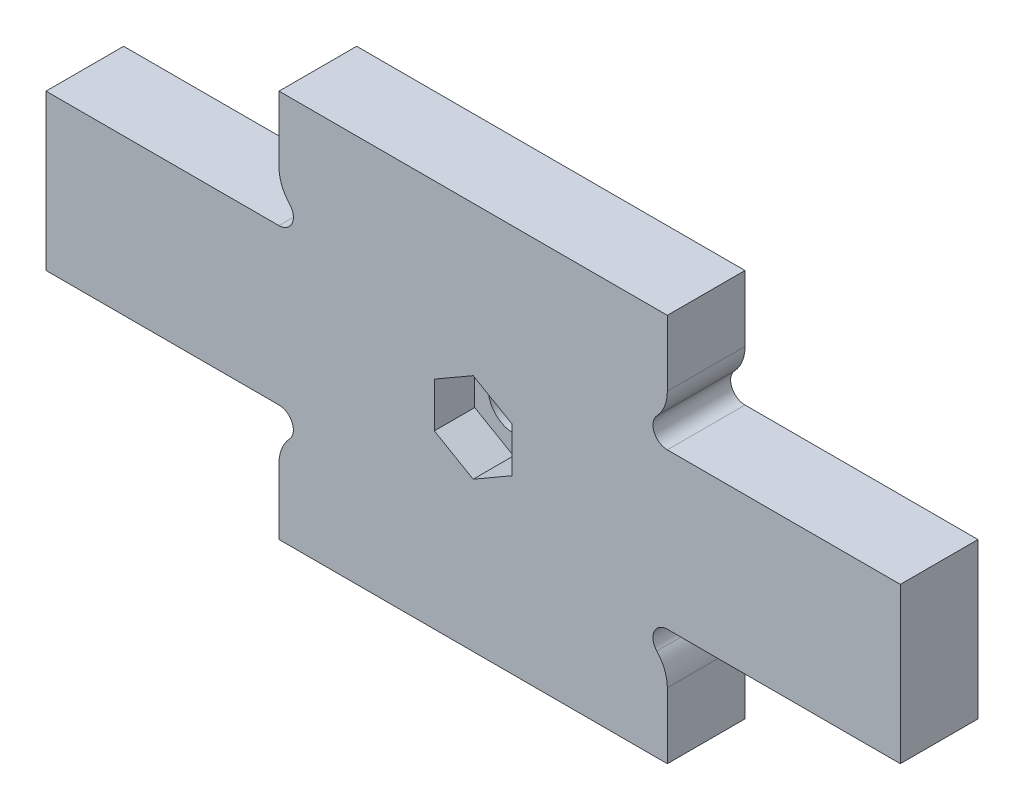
ISO-10303-21;
HEADER;
FILE_DESCRIPTION(('STEP AP214'),'2;1');
FILE_NAME('part.step','',(''),(''),'','','');
FILE_SCHEMA(('AUTOMOTIVE_DESIGN { 1 0 10303 214 1 1 1 1 }'));
ENDSEC;
DATA;
#1=APPLICATION_CONTEXT('core data for automotive mechanical design processes');
#2=APPLICATION_PROTOCOL_DEFINITION('international standard','automotive_design',2000,#1);
#3=PRODUCT_CONTEXT('',#1,'mechanical');
#4=PRODUCT('Part','Part','',(#3));
#5=PRODUCT_RELATED_PRODUCT_CATEGORY('part','',(#4));
#6=PRODUCT_DEFINITION_FORMATION('','',#4);
#7=PRODUCT_DEFINITION_CONTEXT('part definition',#1,'design');
#8=PRODUCT_DEFINITION('design','',#6,#7);
#9=PRODUCT_DEFINITION_SHAPE('','',#8);
#10=(LENGTH_UNIT() NAMED_UNIT(*) SI_UNIT(.MILLI.,.METRE.));
#11=(NAMED_UNIT(*) PLANE_ANGLE_UNIT() SI_UNIT($,.RADIAN.));
#12=(NAMED_UNIT(*) SI_UNIT($,.STERADIAN.) SOLID_ANGLE_UNIT());
#13=UNCERTAINTY_MEASURE_WITH_UNIT(LENGTH_MEASURE(1.E-05),#10,'distance_accuracy_value','');
#14=(GEOMETRIC_REPRESENTATION_CONTEXT(3) GLOBAL_UNCERTAINTY_ASSIGNED_CONTEXT((#13)) GLOBAL_UNIT_ASSIGNED_CONTEXT((#10,
#11,#12)) REPRESENTATION_CONTEXT('',''));
#15=CARTESIAN_POINT('',(0.,0.,0.));
#16=DIRECTION('',(0.,0.,1.));
#17=DIRECTION('',(1.,0.,0.));
#18=AXIS2_PLACEMENT_3D('',#15,#16,#17);
#19=CARTESIAN_POINT('',(0.,0.,0.));
#20=DIRECTION('',(0.,0.,1.));
#21=DIRECTION('',(1.,0.,0.));
#22=AXIS2_PLACEMENT_3D('',#19,#20,#21);
#23=CYLINDRICAL_SURFACE('',#22,3.25);
#24=CARTESIAN_POINT('',(0.,0.,0.));
#25=DIRECTION('',(0.,0.,1.));
#26=DIRECTION('',(1.,0.,0.));
#27=AXIS2_PLACEMENT_3D('',#24,#25,#26);
#28=CIRCLE('',#27,3.25);
#29=CARTESIAN_POINT('',(3.25,0.,0.));
#30=VERTEX_POINT('',#29);
#31=EDGE_CURVE('E227',#30,#30,#28,.T.);
#32=ORIENTED_EDGE('',*,*,#31,.F.);
#33=EDGE_LOOP('',(#32));
#34=FACE_BOUND('',#33,.T.);
#35=CARTESIAN_POINT('',(0.,0.,4.8));
#36=DIRECTION('',(0.,0.,1.));
#37=DIRECTION('',(1.,0.,0.));
#38=AXIS2_PLACEMENT_3D('',#35,#36,#37);
#39=CIRCLE('',#38,3.25);
#40=CARTESIAN_POINT('',(3.25,0.,4.8));
#41=VERTEX_POINT('',#40);
#42=EDGE_CURVE('E45',#41,#41,#39,.F.);
#43=ORIENTED_EDGE('',*,*,#42,.F.);
#44=EDGE_LOOP('',(#43));
#45=FACE_BOUND('',#44,.T.);
#46=ADVANCED_FACE('F41',(#34,#45),#23,.F.);
#47=CARTESIAN_POINT('',(19.9999999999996,-16.5321469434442,10.));
#48=DIRECTION('',(0.,0.,-1.));
#49=DIRECTION('',(-1.,0.,0.));
#50=AXIS2_PLACEMENT_3D('',#47,#48,#49);
#51=CYLINDRICAL_SURFACE('',#50,5.00000000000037);
#52=CARTESIAN_POINT('',(19.9999999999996,-16.5321469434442,0.));
#53=DIRECTION('',(0.,0.,1.));
#54=DIRECTION('',(1.,0.,0.));
#55=AXIS2_PLACEMENT_3D('',#52,#53,#54);
#56=CIRCLE('',#55,5.00000000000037);
#57=CARTESIAN_POINT('',(25.,-16.5321469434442,0.));
#58=VERTEX_POINT('',#57);
#59=CARTESIAN_POINT('',(23.6496350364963,-13.1145214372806,0.));
#60=VERTEX_POINT('',#59);
#61=EDGE_CURVE('E223',#58,#60,#56,.T.);
#62=ORIENTED_EDGE('',*,*,#61,.T.);
#63=DIRECTION('',(0.,0.,-1.));
#64=VECTOR('',#63,1.);
#65=CARTESIAN_POINT('',(23.6496350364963,-13.1145214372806,10.));
#66=LINE('',#65,#64);
#67=CARTESIAN_POINT('',(23.6496350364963,-13.1145214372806,10.));
#68=VERTEX_POINT('',#67);
#69=EDGE_CURVE('E11',#68,#60,#66,.T.);
#70=ORIENTED_EDGE('',*,*,#69,.F.);
#71=CARTESIAN_POINT('',(19.9999999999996,-16.5321469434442,10.));
#72=DIRECTION('',(0.,0.,1.));
#73=DIRECTION('',(1.,0.,0.));
#74=AXIS2_PLACEMENT_3D('',#71,#72,#73);
#75=CIRCLE('',#74,5.00000000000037);
#76=CARTESIAN_POINT('',(25.,-16.5321469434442,10.));
#77=VERTEX_POINT('',#76);
#78=EDGE_CURVE('E263',#77,#68,#75,.T.);
#79=ORIENTED_EDGE('',*,*,#78,.F.);
#80=DIRECTION('',(0.,0.,-1.));
#81=VECTOR('',#80,1.);
#82=CARTESIAN_POINT('',(25.,-16.5321469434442,10.));
#83=LINE('',#82,#81);
#84=EDGE_CURVE('E219',#77,#58,#83,.T.);
#85=ORIENTED_EDGE('',*,*,#84,.T.);
#86=EDGE_LOOP('',(#62,#70,#79,#85));
#87=FACE_BOUND('',#86,.T.);
#88=ADVANCED_FACE('F43',(#87),#51,.T.);
#89=CARTESIAN_POINT('',(25.,-11.8500000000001,10.));
#90=DIRECTION('',(0.,0.,-1.));
#91=DIRECTION('',(-1.,0.,0.));
#92=AXIS2_PLACEMENT_3D('',#89,#90,#91);
#93=CYLINDRICAL_SURFACE('',#92,1.85000000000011);
#94=CARTESIAN_POINT('',(25.,-11.8500000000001,0.));
#95=DIRECTION('',(0.,0.,-1.));
#96=DIRECTION('',(1.,0.,0.));
#97=AXIS2_PLACEMENT_3D('',#94,#95,#96);
#98=CIRCLE('',#97,1.85000000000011);
#99=CARTESIAN_POINT('',(25.,-10.,0.));
#100=VERTEX_POINT('',#99);
#101=EDGE_CURVE('E226',#60,#100,#98,.T.);
#102=ORIENTED_EDGE('',*,*,#101,.T.);
#103=DIRECTION('',(0.,0.,-1.));
#104=VECTOR('',#103,1.);
#105=CARTESIAN_POINT('',(25.,-10.,10.));
#106=LINE('',#105,#104);
#107=CARTESIAN_POINT('',(25.,-10.,10.));
#108=VERTEX_POINT('',#107);
#109=EDGE_CURVE('E50',#108,#100,#106,.T.);
#110=ORIENTED_EDGE('',*,*,#109,.F.);
#111=CARTESIAN_POINT('',(25.,-11.8500000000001,10.));
#112=DIRECTION('',(0.,0.,-1.));
#113=DIRECTION('',(1.,0.,0.));
#114=AXIS2_PLACEMENT_3D('',#111,#112,#113);
#115=CIRCLE('',#114,1.85000000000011);
#116=EDGE_CURVE('E143',#68,#108,#115,.T.);
#117=ORIENTED_EDGE('',*,*,#116,.F.);
#118=ORIENTED_EDGE('',*,*,#69,.T.);
#119=EDGE_LOOP('',(#102,#110,#117,#118));
#120=FACE_BOUND('',#119,.T.);
#121=ADVANCED_FACE('F491',(#120),#93,.F.);
#122=CARTESIAN_POINT('',(25.,-10.,10.));
#123=DIRECTION('',(0.,1.,0.));
#124=DIRECTION('',(-1.,0.,0.));
#125=AXIS2_PLACEMENT_3D('',#122,#123,#124);
#126=PLANE('',#125);
#127=DIRECTION('',(1.,0.,0.));
#128=VECTOR('',#127,1.);
#129=CARTESIAN_POINT('',(25.,-10.,0.));
#130=LINE('',#129,#128);
#131=CARTESIAN_POINT('',(55.,-10.,0.));
#132=VERTEX_POINT('',#131);
#133=EDGE_CURVE('E229',#100,#132,#130,.T.);
#134=ORIENTED_EDGE('',*,*,#133,.T.);
#135=DIRECTION('',(0.,0.,-1.));
#136=VECTOR('',#135,1.);
#137=CARTESIAN_POINT('',(55.,-10.,10.));
#138=LINE('',#137,#136);
#139=CARTESIAN_POINT('',(55.,-10.,10.));
#140=VERTEX_POINT('',#139);
#141=EDGE_CURVE('E306',#140,#132,#138,.T.);
#142=ORIENTED_EDGE('',*,*,#141,.F.);
#143=DIRECTION('',(1.,0.,0.));
#144=VECTOR('',#143,1.);
#145=CARTESIAN_POINT('',(25.,-10.,10.));
#146=LINE('',#145,#144);
#147=EDGE_CURVE('E315',#108,#140,#146,.T.);
#148=ORIENTED_EDGE('',*,*,#147,.F.);
#149=ORIENTED_EDGE('',*,*,#109,.T.);
#150=EDGE_LOOP('',(#134,#142,#148,#149));
#151=FACE_BOUND('',#150,.T.);
#152=ADVANCED_FACE('F313',(#151),#126,.F.);
#153=CARTESIAN_POINT('',(55.,-10.,10.));
#154=DIRECTION('',(-1.,0.,0.));
#155=DIRECTION('',(0.,-1.,0.));
#156=AXIS2_PLACEMENT_3D('',#153,#154,#155);
#157=PLANE('',#156);
#158=DIRECTION('',(0.,1.,0.));
#159=VECTOR('',#158,1.);
#160=CARTESIAN_POINT('',(55.,-10.,0.));
#161=LINE('',#160,#159);
#162=CARTESIAN_POINT('',(55.,10.,0.));
#163=VERTEX_POINT('',#162);
#164=EDGE_CURVE('E231',#132,#163,#161,.T.);
#165=ORIENTED_EDGE('',*,*,#164,.T.);
#166=DIRECTION('',(0.,0.,-1.));
#167=VECTOR('',#166,1.);
#168=CARTESIAN_POINT('',(55.,10.,10.));
#169=LINE('',#168,#167);
#170=CARTESIAN_POINT('',(55.,10.,10.));
#171=VERTEX_POINT('',#170);
#172=EDGE_CURVE('E303',#171,#163,#169,.T.);
#173=ORIENTED_EDGE('',*,*,#172,.F.);
#174=DIRECTION('',(0.,1.,0.));
#175=VECTOR('',#174,1.);
#176=CARTESIAN_POINT('',(55.,-10.,10.));
#177=LINE('',#176,#175);
#178=EDGE_CURVE('E333',#140,#171,#177,.T.);
#179=ORIENTED_EDGE('',*,*,#178,.F.);
#180=ORIENTED_EDGE('',*,*,#141,.T.);
#181=EDGE_LOOP('',(#165,#173,#179,#180));
#182=FACE_BOUND('',#181,.T.);
#183=ADVANCED_FACE('F324',(#182),#157,.F.);
#184=CARTESIAN_POINT('',(55.,10.,10.));
#185=DIRECTION('',(0.,-1.,0.));
#186=DIRECTION('',(0.,0.,-1.));
#187=AXIS2_PLACEMENT_3D('',#184,#185,#186);
#188=PLANE('',#187);
#189=DIRECTION('',(-1.,0.,0.));
#190=VECTOR('',#189,1.);
#191=CARTESIAN_POINT('',(55.,10.,0.));
#192=LINE('',#191,#190);
#193=CARTESIAN_POINT('',(25.,10.,0.));
#194=VERTEX_POINT('',#193);
#195=EDGE_CURVE('E233',#163,#194,#192,.T.);
#196=ORIENTED_EDGE('',*,*,#195,.T.);
#197=DIRECTION('',(0.,0.,-1.));
#198=VECTOR('',#197,1.);
#199=CARTESIAN_POINT('',(25.,10.,10.));
#200=LINE('',#199,#198);
#201=CARTESIAN_POINT('',(25.,10.,10.));
#202=VERTEX_POINT('',#201);
#203=EDGE_CURVE('E300',#202,#194,#200,.T.);
#204=ORIENTED_EDGE('',*,*,#203,.F.);
#205=DIRECTION('',(-1.,0.,0.));
#206=VECTOR('',#205,1.);
#207=CARTESIAN_POINT('',(55.,10.,10.));
#208=LINE('',#207,#206);
#209=EDGE_CURVE('E330',#171,#202,#208,.T.);
#210=ORIENTED_EDGE('',*,*,#209,.F.);
#211=ORIENTED_EDGE('',*,*,#172,.T.);
#212=EDGE_LOOP('',(#196,#204,#210,#211));
#213=FACE_BOUND('',#212,.T.);
#214=ADVANCED_FACE('F328',(#213),#188,.F.);
#215=CARTESIAN_POINT('',(25.,11.8500000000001,10.));
#216=DIRECTION('',(0.,0.,-1.));
#217=DIRECTION('',(-1.,0.,0.));
#218=AXIS2_PLACEMENT_3D('',#215,#216,#217);
#219=CYLINDRICAL_SURFACE('',#218,1.85000000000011);
#220=CARTESIAN_POINT('',(25.,11.8500000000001,0.));
#221=DIRECTION('',(0.,0.,-1.));
#222=DIRECTION('',(1.,0.,0.));
#223=AXIS2_PLACEMENT_3D('',#220,#221,#222);
#224=CIRCLE('',#223,1.85000000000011);
#225=CARTESIAN_POINT('',(23.6496350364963,13.1145214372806,0.));
#226=VERTEX_POINT('',#225);
#227=EDGE_CURVE('E235',#194,#226,#224,.T.);
#228=ORIENTED_EDGE('',*,*,#227,.T.);
#229=DIRECTION('',(0.,0.,-1.));
#230=VECTOR('',#229,1.);
#231=CARTESIAN_POINT('',(23.6496350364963,13.1145214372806,10.));
#232=LINE('',#231,#230);
#233=CARTESIAN_POINT('',(23.6496350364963,13.1145214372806,10.));
#234=VERTEX_POINT('',#233);
#235=EDGE_CURVE('E297',#234,#226,#232,.T.);
#236=ORIENTED_EDGE('',*,*,#235,.F.);
#237=CARTESIAN_POINT('',(25.,11.8500000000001,10.));
#238=DIRECTION('',(0.,0.,-1.));
#239=DIRECTION('',(1.,0.,0.));
#240=AXIS2_PLACEMENT_3D('',#237,#238,#239);
#241=CIRCLE('',#240,1.85000000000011);
#242=EDGE_CURVE('E332',#202,#234,#241,.T.);
#243=ORIENTED_EDGE('',*,*,#242,.F.);
#244=ORIENTED_EDGE('',*,*,#203,.T.);
#245=EDGE_LOOP('',(#228,#236,#243,#244));
#246=FACE_BOUND('',#245,.T.);
#247=ADVANCED_FACE('F545',(#246),#219,.F.);
#248=CARTESIAN_POINT('',(19.9999999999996,16.5321469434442,10.));
#249=DIRECTION('',(0.,0.,-1.));
#250=DIRECTION('',(-1.,0.,0.));
#251=AXIS2_PLACEMENT_3D('',#248,#249,#250);
#252=CYLINDRICAL_SURFACE('',#251,5.00000000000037);
#253=CARTESIAN_POINT('',(19.9999999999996,16.5321469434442,0.));
#254=DIRECTION('',(0.,0.,1.));
#255=DIRECTION('',(1.,0.,0.));
#256=AXIS2_PLACEMENT_3D('',#253,#254,#255);
#257=CIRCLE('',#256,5.00000000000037);
#258=CARTESIAN_POINT('',(25.,16.5321469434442,0.));
#259=VERTEX_POINT('',#258);
#260=EDGE_CURVE('E237',#226,#259,#257,.T.);
#261=ORIENTED_EDGE('',*,*,#260,.T.);
#262=DIRECTION('',(0.,0.,-1.));
#263=VECTOR('',#262,1.);
#264=CARTESIAN_POINT('',(25.,16.5321469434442,10.));
#265=LINE('',#264,#263);
#266=CARTESIAN_POINT('',(25.,16.5321469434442,10.));
#267=VERTEX_POINT('',#266);
#268=EDGE_CURVE('E294',#267,#259,#265,.T.);
#269=ORIENTED_EDGE('',*,*,#268,.F.);
#270=CARTESIAN_POINT('',(19.9999999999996,16.5321469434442,10.));
#271=DIRECTION('',(0.,0.,1.));
#272=DIRECTION('',(1.,0.,0.));
#273=AXIS2_PLACEMENT_3D('',#270,#271,#272);
#274=CIRCLE('',#273,5.00000000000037);
#275=EDGE_CURVE('E335',#234,#267,#274,.T.);
#276=ORIENTED_EDGE('',*,*,#275,.F.);
#277=ORIENTED_EDGE('',*,*,#235,.T.);
#278=EDGE_LOOP('',(#261,#269,#276,#277));
#279=FACE_BOUND('',#278,.T.);
#280=ADVANCED_FACE('F541',(#279),#252,.T.);
#281=CARTESIAN_POINT('',(25.,16.5321469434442,10.));
#282=DIRECTION('',(-1.,0.,0.));
#283=DIRECTION('',(0.,0.,1.));
#284=AXIS2_PLACEMENT_3D('',#281,#282,#283);
#285=PLANE('',#284);
#286=DIRECTION('',(0.,1.,0.));
#287=VECTOR('',#286,1.);
#288=CARTESIAN_POINT('',(25.,16.5321469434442,0.));
#289=LINE('',#288,#287);
#290=CARTESIAN_POINT('',(25.,25.,0.));
#291=VERTEX_POINT('',#290);
#292=EDGE_CURVE('E239',#259,#291,#289,.T.);
#293=ORIENTED_EDGE('',*,*,#292,.T.);
#294=DIRECTION('',(0.,0.,-1.));
#295=VECTOR('',#294,1.);
#296=CARTESIAN_POINT('',(25.,25.,10.));
#297=LINE('',#296,#295);
#298=CARTESIAN_POINT('',(25.,25.,10.));
#299=VERTEX_POINT('',#298);
#300=EDGE_CURVE('E291',#299,#291,#297,.T.);
#301=ORIENTED_EDGE('',*,*,#300,.F.);
#302=DIRECTION('',(0.,1.,0.));
#303=VECTOR('',#302,1.);
#304=CARTESIAN_POINT('',(25.,16.5321469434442,10.));
#305=LINE('',#304,#303);
#306=EDGE_CURVE('E341',#267,#299,#305,.T.);
#307=ORIENTED_EDGE('',*,*,#306,.F.);
#308=ORIENTED_EDGE('',*,*,#268,.T.);
#309=EDGE_LOOP('',(#293,#301,#307,#308));
#310=FACE_BOUND('',#309,.T.);
#311=ADVANCED_FACE('F537',(#310),#285,.F.);
#312=CARTESIAN_POINT('',(25.,25.,10.));
#313=DIRECTION('',(0.,-1.,0.));
#314=DIRECTION('',(0.,0.,-1.));
#315=AXIS2_PLACEMENT_3D('',#312,#313,#314);
#316=PLANE('',#315);
#317=DIRECTION('',(-1.,0.,0.));
#318=VECTOR('',#317,1.);
#319=CARTESIAN_POINT('',(25.,25.,0.));
#320=LINE('',#319,#318);
#321=CARTESIAN_POINT('',(-25.,25.,0.));
#322=VERTEX_POINT('',#321);
#323=EDGE_CURVE('E241',#291,#322,#320,.T.);
#324=ORIENTED_EDGE('',*,*,#323,.T.);
#325=DIRECTION('',(0.,0.,-1.));
#326=VECTOR('',#325,1.);
#327=CARTESIAN_POINT('',(-25.,25.,10.));
#328=LINE('',#327,#326);
#329=CARTESIAN_POINT('',(-25.,25.,10.));
#330=VERTEX_POINT('',#329);
#331=EDGE_CURVE('E288',#330,#322,#328,.T.);
#332=ORIENTED_EDGE('',*,*,#331,.F.);
#333=DIRECTION('',(-1.,0.,0.));
#334=VECTOR('',#333,1.);
#335=CARTESIAN_POINT('',(25.,25.,10.));
#336=LINE('',#335,#334);
#337=EDGE_CURVE('E343',#299,#330,#336,.T.);
#338=ORIENTED_EDGE('',*,*,#337,.F.);
#339=ORIENTED_EDGE('',*,*,#300,.T.);
#340=EDGE_LOOP('',(#324,#332,#338,#339));
#341=FACE_BOUND('',#340,.T.);
#342=ADVANCED_FACE('F533',(#341),#316,.F.);
#343=CARTESIAN_POINT('',(-25.,25.,10.));
#344=DIRECTION('',(1.,0.,0.));
#345=DIRECTION('',(0.,0.,-1.));
#346=AXIS2_PLACEMENT_3D('',#343,#344,#345);
#347=PLANE('',#346);
#348=DIRECTION('',(0.,-1.,0.));
#349=VECTOR('',#348,1.);
#350=CARTESIAN_POINT('',(-25.,25.,0.));
#351=LINE('',#350,#349);
#352=CARTESIAN_POINT('',(-25.,16.5321469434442,0.));
#353=VERTEX_POINT('',#352);
#354=EDGE_CURVE('E243',#322,#353,#351,.T.);
#355=ORIENTED_EDGE('',*,*,#354,.T.);
#356=DIRECTION('',(0.,0.,-1.));
#357=VECTOR('',#356,1.);
#358=CARTESIAN_POINT('',(-25.,16.5321469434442,10.));
#359=LINE('',#358,#357);
#360=CARTESIAN_POINT('',(-25.,16.5321469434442,10.));
#361=VERTEX_POINT('',#360);
#362=EDGE_CURVE('E285',#361,#353,#359,.T.);
#363=ORIENTED_EDGE('',*,*,#362,.F.);
#364=DIRECTION('',(0.,-1.,0.));
#365=VECTOR('',#364,1.);
#366=CARTESIAN_POINT('',(-25.,25.,10.));
#367=LINE('',#366,#365);
#368=EDGE_CURVE('E345',#330,#361,#367,.T.);
#369=ORIENTED_EDGE('',*,*,#368,.F.);
#370=ORIENTED_EDGE('',*,*,#331,.T.);
#371=EDGE_LOOP('',(#355,#363,#369,#370));
#372=FACE_BOUND('',#371,.T.);
#373=ADVANCED_FACE('F529',(#372),#347,.F.);
#374=CARTESIAN_POINT('',(-19.9999999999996,16.5321469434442,10.));
#375=DIRECTION('',(0.,0.,-1.));
#376=DIRECTION('',(-1.,0.,0.));
#377=AXIS2_PLACEMENT_3D('',#374,#375,#376);
#378=CYLINDRICAL_SURFACE('',#377,5.00000000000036);
#379=CARTESIAN_POINT('',(-19.9999999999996,16.5321469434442,0.));
#380=DIRECTION('',(0.,0.,1.));
#381=DIRECTION('',(1.,0.,0.));
#382=AXIS2_PLACEMENT_3D('',#379,#380,#381);
#383=CIRCLE('',#382,5.00000000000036);
#384=CARTESIAN_POINT('',(-23.6496350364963,13.1145214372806,0.));
#385=VERTEX_POINT('',#384);
#386=EDGE_CURVE('E245',#353,#385,#383,.T.);
#387=ORIENTED_EDGE('',*,*,#386,.T.);
#388=DIRECTION('',(0.,0.,-1.));
#389=VECTOR('',#388,1.);
#390=CARTESIAN_POINT('',(-23.6496350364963,13.1145214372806,10.));
#391=LINE('',#390,#389);
#392=CARTESIAN_POINT('',(-23.6496350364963,13.1145214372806,10.));
#393=VERTEX_POINT('',#392);
#394=EDGE_CURVE('E282',#393,#385,#391,.T.);
#395=ORIENTED_EDGE('',*,*,#394,.F.);
#396=CARTESIAN_POINT('',(-19.9999999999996,16.5321469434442,10.));
#397=DIRECTION('',(0.,0.,1.));
#398=DIRECTION('',(1.,0.,0.));
#399=AXIS2_PLACEMENT_3D('',#396,#397,#398);
#400=CIRCLE('',#399,5.00000000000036);
#401=EDGE_CURVE('E347',#361,#393,#400,.T.);
#402=ORIENTED_EDGE('',*,*,#401,.F.);
#403=ORIENTED_EDGE('',*,*,#362,.T.);
#404=EDGE_LOOP('',(#387,#395,#402,#403));
#405=FACE_BOUND('',#404,.T.);
#406=ADVANCED_FACE('F525',(#405),#378,.T.);
#407=CARTESIAN_POINT('',(-25.,11.8500000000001,10.));
#408=DIRECTION('',(0.,0.,-1.));
#409=DIRECTION('',(-1.,0.,0.));
#410=AXIS2_PLACEMENT_3D('',#407,#408,#409);
#411=CYLINDRICAL_SURFACE('',#410,1.85000000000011);
#412=CARTESIAN_POINT('',(-25.,11.8500000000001,0.));
#413=DIRECTION('',(0.,0.,-1.));
#414=DIRECTION('',(1.,0.,0.));
#415=AXIS2_PLACEMENT_3D('',#412,#413,#414);
#416=CIRCLE('',#415,1.85000000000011);
#417=CARTESIAN_POINT('',(-25.,10.,0.));
#418=VERTEX_POINT('',#417);
#419=EDGE_CURVE('E247',#385,#418,#416,.T.);
#420=ORIENTED_EDGE('',*,*,#419,.T.);
#421=DIRECTION('',(0.,0.,-1.));
#422=VECTOR('',#421,1.);
#423=CARTESIAN_POINT('',(-25.,10.,10.));
#424=LINE('',#423,#422);
#425=CARTESIAN_POINT('',(-25.,10.,10.));
#426=VERTEX_POINT('',#425);
#427=EDGE_CURVE('E279',#426,#418,#424,.T.);
#428=ORIENTED_EDGE('',*,*,#427,.F.);
#429=CARTESIAN_POINT('',(-25.,11.8500000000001,10.));
#430=DIRECTION('',(0.,0.,-1.));
#431=DIRECTION('',(1.,0.,0.));
#432=AXIS2_PLACEMENT_3D('',#429,#430,#431);
#433=CIRCLE('',#432,1.85000000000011);
#434=EDGE_CURVE('E349',#393,#426,#433,.T.);
#435=ORIENTED_EDGE('',*,*,#434,.F.);
#436=ORIENTED_EDGE('',*,*,#394,.T.);
#437=EDGE_LOOP('',(#420,#428,#435,#436));
#438=FACE_BOUND('',#437,.T.);
#439=ADVANCED_FACE('F521',(#438),#411,.F.);
#440=CARTESIAN_POINT('',(-25.,10.,10.));
#441=DIRECTION('',(0.,-1.,0.));
#442=DIRECTION('',(0.,0.,-1.));
#443=AXIS2_PLACEMENT_3D('',#440,#441,#442);
#444=PLANE('',#443);
#445=DIRECTION('',(-1.,0.,0.));
#446=VECTOR('',#445,1.);
#447=CARTESIAN_POINT('',(-25.,10.,0.));
#448=LINE('',#447,#446);
#449=CARTESIAN_POINT('',(-55.,10.,0.));
#450=VERTEX_POINT('',#449);
#451=EDGE_CURVE('E249',#418,#450,#448,.T.);
#452=ORIENTED_EDGE('',*,*,#451,.T.);
#453=DIRECTION('',(0.,0.,-1.));
#454=VECTOR('',#453,1.);
#455=CARTESIAN_POINT('',(-55.,10.,10.));
#456=LINE('',#455,#454);
#457=CARTESIAN_POINT('',(-55.,10.,10.));
#458=VERTEX_POINT('',#457);
#459=EDGE_CURVE('E276',#458,#450,#456,.T.);
#460=ORIENTED_EDGE('',*,*,#459,.F.);
#461=DIRECTION('',(-1.,0.,0.));
#462=VECTOR('',#461,1.);
#463=CARTESIAN_POINT('',(-25.,10.,10.));
#464=LINE('',#463,#462);
#465=EDGE_CURVE('E351',#426,#458,#464,.T.);
#466=ORIENTED_EDGE('',*,*,#465,.F.);
#467=ORIENTED_EDGE('',*,*,#427,.T.);
#468=EDGE_LOOP('',(#452,#460,#466,#467));
#469=FACE_BOUND('',#468,.T.);
#470=ADVANCED_FACE('F517',(#469),#444,.F.);
#471=CARTESIAN_POINT('',(-55.,10.,10.));
#472=DIRECTION('',(1.,0.,0.));
#473=DIRECTION('',(0.,1.,0.));
#474=AXIS2_PLACEMENT_3D('',#471,#472,#473);
#475=PLANE('',#474);
#476=DIRECTION('',(0.,-1.,0.));
#477=VECTOR('',#476,1.);
#478=CARTESIAN_POINT('',(-55.,10.,0.));
#479=LINE('',#478,#477);
#480=CARTESIAN_POINT('',(-55.,-10.,0.));
#481=VERTEX_POINT('',#480);
#482=EDGE_CURVE('E251',#450,#481,#479,.T.);
#483=ORIENTED_EDGE('',*,*,#482,.T.);
#484=DIRECTION('',(0.,0.,-1.));
#485=VECTOR('',#484,1.);
#486=CARTESIAN_POINT('',(-55.,-10.,10.));
#487=LINE('',#486,#485);
#488=CARTESIAN_POINT('',(-55.,-10.,10.));
#489=VERTEX_POINT('',#488);
#490=EDGE_CURVE('E273',#489,#481,#487,.T.);
#491=ORIENTED_EDGE('',*,*,#490,.F.);
#492=DIRECTION('',(0.,-1.,0.));
#493=VECTOR('',#492,1.);
#494=CARTESIAN_POINT('',(-55.,10.,10.));
#495=LINE('',#494,#493);
#496=EDGE_CURVE('E353',#458,#489,#495,.T.);
#497=ORIENTED_EDGE('',*,*,#496,.F.);
#498=ORIENTED_EDGE('',*,*,#459,.T.);
#499=EDGE_LOOP('',(#483,#491,#497,#498));
#500=FACE_BOUND('',#499,.T.);
#501=ADVANCED_FACE('F513',(#500),#475,.F.);
#502=CARTESIAN_POINT('',(-55.,-10.,10.));
#503=DIRECTION('',(0.,1.,0.));
#504=DIRECTION('',(-1.,0.,0.));
#505=AXIS2_PLACEMENT_3D('',#502,#503,#504);
#506=PLANE('',#505);
#507=DIRECTION('',(1.,0.,0.));
#508=VECTOR('',#507,1.);
#509=CARTESIAN_POINT('',(-55.,-10.,0.));
#510=LINE('',#509,#508);
#511=CARTESIAN_POINT('',(-25.,-10.,0.));
#512=VERTEX_POINT('',#511);
#513=EDGE_CURVE('E253',#481,#512,#510,.T.);
#514=ORIENTED_EDGE('',*,*,#513,.T.);
#515=DIRECTION('',(0.,0.,-1.));
#516=VECTOR('',#515,1.);
#517=CARTESIAN_POINT('',(-25.,-10.,10.));
#518=LINE('',#517,#516);
#519=CARTESIAN_POINT('',(-25.,-10.,10.));
#520=VERTEX_POINT('',#519);
#521=EDGE_CURVE('E270',#520,#512,#518,.T.);
#522=ORIENTED_EDGE('',*,*,#521,.F.);
#523=DIRECTION('',(1.,0.,0.));
#524=VECTOR('',#523,1.);
#525=CARTESIAN_POINT('',(-55.,-10.,10.));
#526=LINE('',#525,#524);
#527=EDGE_CURVE('E355',#489,#520,#526,.T.);
#528=ORIENTED_EDGE('',*,*,#527,.F.);
#529=ORIENTED_EDGE('',*,*,#490,.T.);
#530=EDGE_LOOP('',(#514,#522,#528,#529));
#531=FACE_BOUND('',#530,.T.);
#532=ADVANCED_FACE('F510',(#531),#506,.F.);
#533=CARTESIAN_POINT('',(-25.,-11.8500000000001,10.));
#534=DIRECTION('',(0.,0.,-1.));
#535=DIRECTION('',(-1.,0.,0.));
#536=AXIS2_PLACEMENT_3D('',#533,#534,#535);
#537=CYLINDRICAL_SURFACE('',#536,1.85000000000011);
#538=CARTESIAN_POINT('',(-25.,-11.8500000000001,0.));
#539=DIRECTION('',(0.,0.,-1.));
#540=DIRECTION('',(1.,0.,0.));
#541=AXIS2_PLACEMENT_3D('',#538,#539,#540);
#542=CIRCLE('',#541,1.85000000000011);
#543=CARTESIAN_POINT('',(-23.6496350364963,-13.1145214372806,0.));
#544=VERTEX_POINT('',#543);
#545=EDGE_CURVE('E255',#512,#544,#542,.T.);
#546=ORIENTED_EDGE('',*,*,#545,.T.);
#547=DIRECTION('',(0.,0.,-1.));
#548=VECTOR('',#547,1.);
#549=CARTESIAN_POINT('',(-23.6496350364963,-13.1145214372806,10.));
#550=LINE('',#549,#548);
#551=CARTESIAN_POINT('',(-23.6496350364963,-13.1145214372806,10.));
#552=VERTEX_POINT('',#551);
#553=EDGE_CURVE('E267',#552,#544,#550,.T.);
#554=ORIENTED_EDGE('',*,*,#553,.F.);
#555=CARTESIAN_POINT('',(-25.,-11.8500000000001,10.));
#556=DIRECTION('',(0.,0.,-1.));
#557=DIRECTION('',(1.,0.,0.));
#558=AXIS2_PLACEMENT_3D('',#555,#556,#557);
#559=CIRCLE('',#558,1.85000000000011);
#560=EDGE_CURVE('E357',#520,#552,#559,.T.);
#561=ORIENTED_EDGE('',*,*,#560,.F.);
#562=ORIENTED_EDGE('',*,*,#521,.T.);
#563=EDGE_LOOP('',(#546,#554,#561,#562));
#564=FACE_BOUND('',#563,.T.);
#565=ADVANCED_FACE('F363',(#564),#537,.F.);
#566=CARTESIAN_POINT('',(-19.9999999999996,-16.5321469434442,10.));
#567=DIRECTION('',(0.,0.,-1.));
#568=DIRECTION('',(-1.,0.,0.));
#569=AXIS2_PLACEMENT_3D('',#566,#567,#568);
#570=CYLINDRICAL_SURFACE('',#569,5.00000000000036);
#571=CARTESIAN_POINT('',(-19.9999999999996,-16.5321469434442,0.));
#572=DIRECTION('',(0.,0.,1.));
#573=DIRECTION('',(1.,0.,0.));
#574=AXIS2_PLACEMENT_3D('',#571,#572,#573);
#575=CIRCLE('',#574,5.00000000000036);
#576=CARTESIAN_POINT('',(-25.,-16.5321469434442,0.));
#577=VERTEX_POINT('',#576);
#578=EDGE_CURVE('E257',#544,#577,#575,.T.);
#579=ORIENTED_EDGE('',*,*,#578,.T.);
#580=DIRECTION('',(0.,0.,-1.));
#581=VECTOR('',#580,1.);
#582=CARTESIAN_POINT('',(-25.,-16.5321469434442,10.));
#583=LINE('',#582,#581);
#584=CARTESIAN_POINT('',(-25.,-16.5321469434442,10.));
#585=VERTEX_POINT('',#584);
#586=EDGE_CURVE('E214',#585,#577,#583,.T.);
#587=ORIENTED_EDGE('',*,*,#586,.F.);
#588=CARTESIAN_POINT('',(-19.9999999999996,-16.5321469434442,10.));
#589=DIRECTION('',(0.,0.,1.));
#590=DIRECTION('',(1.,0.,0.));
#591=AXIS2_PLACEMENT_3D('',#588,#589,#590);
#592=CIRCLE('',#591,5.00000000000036);
#593=EDGE_CURVE('E202',#552,#585,#592,.T.);
#594=ORIENTED_EDGE('',*,*,#593,.F.);
#595=ORIENTED_EDGE('',*,*,#553,.T.);
#596=EDGE_LOOP('',(#579,#587,#594,#595));
#597=FACE_BOUND('',#596,.T.);
#598=ADVANCED_FACE('F367',(#597),#570,.T.);
#599=CARTESIAN_POINT('',(-25.,-16.5321469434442,10.));
#600=DIRECTION('',(1.,0.,0.));
#601=DIRECTION('',(0.,0.,-1.));
#602=AXIS2_PLACEMENT_3D('',#599,#600,#601);
#603=PLANE('',#602);
#604=DIRECTION('',(0.,-1.,0.));
#605=VECTOR('',#604,1.);
#606=CARTESIAN_POINT('',(-25.,-16.5321469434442,0.));
#607=LINE('',#606,#605);
#608=CARTESIAN_POINT('',(-25.,-25.,0.));
#609=VERTEX_POINT('',#608);
#610=EDGE_CURVE('E211',#577,#609,#607,.T.);
#611=ORIENTED_EDGE('',*,*,#610,.T.);
#612=DIRECTION('',(0.,0.,-1.));
#613=VECTOR('',#612,1.);
#614=CARTESIAN_POINT('',(-25.,-25.,10.));
#615=LINE('',#614,#613);
#616=CARTESIAN_POINT('',(-25.,-25.,10.));
#617=VERTEX_POINT('',#616);
#618=EDGE_CURVE('E208',#617,#609,#615,.T.);
#619=ORIENTED_EDGE('',*,*,#618,.F.);
#620=DIRECTION('',(0.,-1.,0.));
#621=VECTOR('',#620,1.);
#622=CARTESIAN_POINT('',(-25.,-16.5321469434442,10.));
#623=LINE('',#622,#621);
#624=EDGE_CURVE('E195',#585,#617,#623,.T.);
#625=ORIENTED_EDGE('',*,*,#624,.F.);
#626=ORIENTED_EDGE('',*,*,#586,.T.);
#627=EDGE_LOOP('',(#611,#619,#625,#626));
#628=FACE_BOUND('',#627,.T.);
#629=ADVANCED_FACE('F209',(#628),#603,.F.);
#630=CARTESIAN_POINT('',(-25.,-25.,10.));
#631=DIRECTION('',(0.,1.,0.));
#632=DIRECTION('',(0.,0.,1.));
#633=AXIS2_PLACEMENT_3D('',#630,#631,#632);
#634=PLANE('',#633);
#635=DIRECTION('',(1.,0.,0.));
#636=VECTOR('',#635,1.);
#637=CARTESIAN_POINT('',(-25.,-25.,0.));
#638=LINE('',#637,#636);
#639=CARTESIAN_POINT('',(25.,-25.,0.));
#640=VERTEX_POINT('',#639);
#641=EDGE_CURVE('E260',#609,#640,#638,.T.);
#642=ORIENTED_EDGE('',*,*,#641,.T.);
#643=DIRECTION('',(0.,0.,-1.));
#644=VECTOR('',#643,1.);
#645=CARTESIAN_POINT('',(25.,-25.,10.));
#646=LINE('',#645,#644);
#647=CARTESIAN_POINT('',(25.,-25.,10.));
#648=VERTEX_POINT('',#647);
#649=EDGE_CURVE('E215',#648,#640,#646,.T.);
#650=ORIENTED_EDGE('',*,*,#649,.F.);
#651=DIRECTION('',(1.,0.,0.));
#652=VECTOR('',#651,1.);
#653=CARTESIAN_POINT('',(-25.,-25.,10.));
#654=LINE('',#653,#652);
#655=EDGE_CURVE('E199',#617,#648,#654,.T.);
#656=ORIENTED_EDGE('',*,*,#655,.F.);
#657=ORIENTED_EDGE('',*,*,#618,.T.);
#658=EDGE_LOOP('',(#642,#650,#656,#657));
#659=FACE_BOUND('',#658,.T.);
#660=ADVANCED_FACE('F217',(#659),#634,.F.);
#661=CARTESIAN_POINT('',(25.,-25.,10.));
#662=DIRECTION('',(-1.,0.,0.));
#663=DIRECTION('',(0.,0.,1.));
#664=AXIS2_PLACEMENT_3D('',#661,#662,#663);
#665=PLANE('',#664);
#666=DIRECTION('',(0.,1.,0.));
#667=VECTOR('',#666,1.);
#668=CARTESIAN_POINT('',(25.,-25.,0.));
#669=LINE('',#668,#667);
#670=EDGE_CURVE('E135',#640,#58,#669,.T.);
#671=ORIENTED_EDGE('',*,*,#670,.T.);
#672=ORIENTED_EDGE('',*,*,#84,.F.);
#673=DIRECTION('',(0.,1.,0.));
#674=VECTOR('',#673,1.);
#675=CARTESIAN_POINT('',(25.,-25.,10.));
#676=LINE('',#675,#674);
#677=EDGE_CURVE('E66',#648,#77,#676,.T.);
#678=ORIENTED_EDGE('',*,*,#677,.F.);
#679=ORIENTED_EDGE('',*,*,#649,.T.);
#680=EDGE_LOOP('',(#671,#672,#678,#679));
#681=FACE_BOUND('',#680,.T.);
#682=ADVANCED_FACE('F368',(#681),#665,.F.);
#683=CARTESIAN_POINT('',(19.9999999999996,-16.5321469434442,10.));
#684=DIRECTION('',(0.,0.,1.));
#685=DIRECTION('',(1.,0.,0.));
#686=AXIS2_PLACEMENT_3D('',#683,#684,#685);
#687=PLANE('',#686);
#688=DIRECTION('',(0.866025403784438,0.5,0.));
#689=VECTOR('',#688,1.);
#690=CARTESIAN_POINT('',(0.,-5.77350269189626,10.));
#691=LINE('',#690,#689);
#692=CARTESIAN_POINT('',(0.,-5.77350269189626,10.));
#693=VERTEX_POINT('',#692);
#694=CARTESIAN_POINT('',(5.,-2.88675134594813,10.));
#695=VERTEX_POINT('',#694);
#696=EDGE_CURVE('E57',#693,#695,#691,.T.);
#697=ORIENTED_EDGE('',*,*,#696,.F.);
#698=DIRECTION('',(0.866025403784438,-0.5,0.));
#699=VECTOR('',#698,1.);
#700=CARTESIAN_POINT('',(-5.00000000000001,-2.88675134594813,10.));
#701=LINE('',#700,#699);
#702=CARTESIAN_POINT('',(-5.00000000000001,-2.88675134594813,10.));
#703=VERTEX_POINT('',#702);
#704=EDGE_CURVE('E394',#703,#693,#701,.T.);
#705=ORIENTED_EDGE('',*,*,#704,.F.);
#706=DIRECTION('',(0.,-1.,0.));
#707=VECTOR('',#706,1.);
#708=CARTESIAN_POINT('',(-5.,2.88675134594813,10.));
#709=LINE('',#708,#707);
#710=CARTESIAN_POINT('',(-5.,2.88675134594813,10.));
#711=VERTEX_POINT('',#710);
#712=EDGE_CURVE('E398',#711,#703,#709,.T.);
#713=ORIENTED_EDGE('',*,*,#712,.F.);
#714=DIRECTION('',(-0.866025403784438,-0.5,0.));
#715=VECTOR('',#714,1.);
#716=CARTESIAN_POINT('',(0.,5.77350269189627,10.));
#717=LINE('',#716,#715);
#718=CARTESIAN_POINT('',(0.,5.77350269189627,10.));
#719=VERTEX_POINT('',#718);
#720=EDGE_CURVE('E401',#719,#711,#717,.T.);
#721=ORIENTED_EDGE('',*,*,#720,.F.);
#722=DIRECTION('',(-0.866025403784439,0.5,0.));
#723=VECTOR('',#722,1.);
#724=CARTESIAN_POINT('',(5.,2.88675134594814,10.));
#725=LINE('',#724,#723);
#726=CARTESIAN_POINT('',(5.,2.88675134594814,10.));
#727=VERTEX_POINT('',#726);
#728=EDGE_CURVE('E404',#727,#719,#725,.T.);
#729=ORIENTED_EDGE('',*,*,#728,.F.);
#730=DIRECTION('',(0.,1.,0.));
#731=VECTOR('',#730,1.);
#732=CARTESIAN_POINT('',(5.,-2.88675134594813,10.));
#733=LINE('',#732,#731);
#734=EDGE_CURVE('E407',#695,#727,#733,.T.);
#735=ORIENTED_EDGE('',*,*,#734,.F.);
#736=EDGE_LOOP('',(#697,#705,#713,#721,#729,#735));
#737=FACE_BOUND('',#736,.T.);
#738=ORIENTED_EDGE('',*,*,#78,.T.);
#739=ORIENTED_EDGE('',*,*,#116,.T.);
#740=ORIENTED_EDGE('',*,*,#147,.T.);
#741=ORIENTED_EDGE('',*,*,#178,.T.);
#742=ORIENTED_EDGE('',*,*,#209,.T.);
#743=ORIENTED_EDGE('',*,*,#242,.T.);
#744=ORIENTED_EDGE('',*,*,#275,.T.);
#745=ORIENTED_EDGE('',*,*,#306,.T.);
#746=ORIENTED_EDGE('',*,*,#337,.T.);
#747=ORIENTED_EDGE('',*,*,#368,.T.);
#748=ORIENTED_EDGE('',*,*,#401,.T.);
#749=ORIENTED_EDGE('',*,*,#434,.T.);
#750=ORIENTED_EDGE('',*,*,#465,.T.);
#751=ORIENTED_EDGE('',*,*,#496,.T.);
#752=ORIENTED_EDGE('',*,*,#527,.T.);
#753=ORIENTED_EDGE('',*,*,#560,.T.);
#754=ORIENTED_EDGE('',*,*,#593,.T.);
#755=ORIENTED_EDGE('',*,*,#624,.T.);
#756=ORIENTED_EDGE('',*,*,#655,.T.);
#757=ORIENTED_EDGE('',*,*,#677,.T.);
#758=EDGE_LOOP('',(#738,#739,#740,#741,#742,#743,#744,#745,#746,#747,#748,#749,#750,#751,#752,
#753,#754,#755,#756,#757));
#759=FACE_BOUND('',#758,.T.);
#760=ADVANCED_FACE('F197',(#737,#759),#687,.T.);
#761=CARTESIAN_POINT('',(19.9999999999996,-16.5321469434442,0.));
#762=DIRECTION('',(0.,0.,1.));
#763=DIRECTION('',(1.,0.,0.));
#764=AXIS2_PLACEMENT_3D('',#761,#762,#763);
#765=PLANE('',#764);
#766=ORIENTED_EDGE('',*,*,#31,.T.);
#767=EDGE_LOOP('',(#766));
#768=FACE_BOUND('',#767,.T.);
#769=ORIENTED_EDGE('',*,*,#61,.F.);
#770=ORIENTED_EDGE('',*,*,#670,.F.);
#771=ORIENTED_EDGE('',*,*,#641,.F.);
#772=ORIENTED_EDGE('',*,*,#610,.F.);
#773=ORIENTED_EDGE('',*,*,#578,.F.);
#774=ORIENTED_EDGE('',*,*,#545,.F.);
#775=ORIENTED_EDGE('',*,*,#513,.F.);
#776=ORIENTED_EDGE('',*,*,#482,.F.);
#777=ORIENTED_EDGE('',*,*,#451,.F.);
#778=ORIENTED_EDGE('',*,*,#419,.F.);
#779=ORIENTED_EDGE('',*,*,#386,.F.);
#780=ORIENTED_EDGE('',*,*,#354,.F.);
#781=ORIENTED_EDGE('',*,*,#323,.F.);
#782=ORIENTED_EDGE('',*,*,#292,.F.);
#783=ORIENTED_EDGE('',*,*,#260,.F.);
#784=ORIENTED_EDGE('',*,*,#227,.F.);
#785=ORIENTED_EDGE('',*,*,#195,.F.);
#786=ORIENTED_EDGE('',*,*,#164,.F.);
#787=ORIENTED_EDGE('',*,*,#133,.F.);
#788=ORIENTED_EDGE('',*,*,#101,.F.);
#789=EDGE_LOOP('',(#769,#770,#771,#772,#773,#774,#775,#776,#777,#778,#779,#780,#781,#782,#783,
#784,#785,#786,#787,#788));
#790=FACE_BOUND('',#789,.T.);
#791=ADVANCED_FACE('F319',(#768,#790),#765,.F.);
#792=CARTESIAN_POINT('',(0.,0.,4.8));
#793=DIRECTION('',(0.,0.,1.));
#794=DIRECTION('',(1.,0.,0.));
#795=AXIS2_PLACEMENT_3D('',#792,#793,#794);
#796=PLANE('',#795);
#797=DIRECTION('',(0.866025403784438,0.5,0.));
#798=VECTOR('',#797,1.);
#799=CARTESIAN_POINT('',(0.,-5.77350269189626,4.8));
#800=LINE('',#799,#798);
#801=CARTESIAN_POINT('',(0.,-5.77350269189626,4.8));
#802=VERTEX_POINT('',#801);
#803=CARTESIAN_POINT('',(5.,-2.88675134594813,4.8));
#804=VERTEX_POINT('',#803);
#805=EDGE_CURVE('E397',#802,#804,#800,.T.);
#806=ORIENTED_EDGE('',*,*,#805,.T.);
#807=DIRECTION('',(0.,1.,0.));
#808=VECTOR('',#807,1.);
#809=CARTESIAN_POINT('',(5.,-2.88675134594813,4.8));
#810=LINE('',#809,#808);
#811=CARTESIAN_POINT('',(5.,2.88675134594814,4.8));
#812=VERTEX_POINT('',#811);
#813=EDGE_CURVE('E422',#804,#812,#810,.T.);
#814=ORIENTED_EDGE('',*,*,#813,.T.);
#815=DIRECTION('',(-0.866025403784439,0.5,0.));
#816=VECTOR('',#815,1.);
#817=CARTESIAN_POINT('',(5.,2.88675134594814,4.8));
#818=LINE('',#817,#816);
#819=CARTESIAN_POINT('',(0.,5.77350269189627,4.8));
#820=VERTEX_POINT('',#819);
#821=EDGE_CURVE('E419',#812,#820,#818,.T.);
#822=ORIENTED_EDGE('',*,*,#821,.T.);
#823=DIRECTION('',(-0.866025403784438,-0.5,0.));
#824=VECTOR('',#823,1.);
#825=CARTESIAN_POINT('',(0.,5.77350269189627,4.8));
#826=LINE('',#825,#824);
#827=CARTESIAN_POINT('',(-5.,2.88675134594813,4.8));
#828=VERTEX_POINT('',#827);
#829=EDGE_CURVE('E416',#820,#828,#826,.T.);
#830=ORIENTED_EDGE('',*,*,#829,.T.);
#831=DIRECTION('',(0.,-1.,0.));
#832=VECTOR('',#831,1.);
#833=CARTESIAN_POINT('',(-5.,2.88675134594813,4.8));
#834=LINE('',#833,#832);
#835=CARTESIAN_POINT('',(-5.00000000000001,-2.88675134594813,4.8));
#836=VERTEX_POINT('',#835);
#837=EDGE_CURVE('E413',#828,#836,#834,.T.);
#838=ORIENTED_EDGE('',*,*,#837,.T.);
#839=DIRECTION('',(0.866025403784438,-0.5,0.));
#840=VECTOR('',#839,1.);
#841=CARTESIAN_POINT('',(-5.00000000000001,-2.88675134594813,4.8));
#842=LINE('',#841,#840);
#843=EDGE_CURVE('E380',#836,#802,#842,.T.);
#844=ORIENTED_EDGE('',*,*,#843,.T.);
#845=EDGE_LOOP('',(#806,#814,#822,#830,#838,#844));
#846=FACE_BOUND('',#845,.T.);
#847=ORIENTED_EDGE('',*,*,#42,.T.);
#848=EDGE_LOOP('',(#847));
#849=FACE_BOUND('',#848,.T.);
#850=ADVANCED_FACE('F429',(#846,#849),#796,.T.);
#851=CARTESIAN_POINT('',(0.,-5.77350269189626,4.8));
#852=DIRECTION('',(0.5,-0.866025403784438,0.));
#853=DIRECTION('',(0.866025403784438,0.5,0.));
#854=AXIS2_PLACEMENT_3D('',#851,#852,#853);
#855=PLANE('',#854);
#856=ORIENTED_EDGE('',*,*,#696,.T.);
#857=DIRECTION('',(0.,0.,1.));
#858=VECTOR('',#857,1.);
#859=CARTESIAN_POINT('',(5.,-2.88675134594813,4.8));
#860=LINE('',#859,#858);
#861=EDGE_CURVE('E377',#804,#695,#860,.T.);
#862=ORIENTED_EDGE('',*,*,#861,.F.);
#863=ORIENTED_EDGE('',*,*,#805,.F.);
#864=DIRECTION('',(0.,0.,1.));
#865=VECTOR('',#864,1.);
#866=CARTESIAN_POINT('',(0.,-5.77350269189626,4.8));
#867=LINE('',#866,#865);
#868=EDGE_CURVE('E392',#802,#693,#867,.T.);
#869=ORIENTED_EDGE('',*,*,#868,.T.);
#870=EDGE_LOOP('',(#856,#862,#863,#869));
#871=FACE_BOUND('',#870,.T.);
#872=ADVANCED_FACE('F435',(#871),#855,.F.);
#873=CARTESIAN_POINT('',(-5.00000000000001,-2.88675134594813,4.8));
#874=DIRECTION('',(-0.5,-0.866025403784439,0.));
#875=DIRECTION('',(0.866025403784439,-0.5,0.));
#876=AXIS2_PLACEMENT_3D('',#873,#874,#875);
#877=PLANE('',#876);
#878=ORIENTED_EDGE('',*,*,#704,.T.);
#879=ORIENTED_EDGE('',*,*,#868,.F.);
#880=ORIENTED_EDGE('',*,*,#843,.F.);
#881=DIRECTION('',(0.,0.,1.));
#882=VECTOR('',#881,1.);
#883=CARTESIAN_POINT('',(-5.00000000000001,-2.88675134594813,4.8));
#884=LINE('',#883,#882);
#885=EDGE_CURVE('E389',#836,#703,#884,.T.);
#886=ORIENTED_EDGE('',*,*,#885,.T.);
#887=EDGE_LOOP('',(#878,#879,#880,#886));
#888=FACE_BOUND('',#887,.T.);
#889=ADVANCED_FACE('F451',(#888),#877,.F.);
#890=CARTESIAN_POINT('',(-5.,2.88675134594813,4.8));
#891=DIRECTION('',(-1.,0.,0.));
#892=DIRECTION('',(0.,-1.,0.));
#893=AXIS2_PLACEMENT_3D('',#890,#891,#892);
#894=PLANE('',#893);
#895=ORIENTED_EDGE('',*,*,#712,.T.);
#896=ORIENTED_EDGE('',*,*,#885,.F.);
#897=ORIENTED_EDGE('',*,*,#837,.F.);
#898=DIRECTION('',(0.,0.,1.));
#899=VECTOR('',#898,1.);
#900=CARTESIAN_POINT('',(-5.,2.88675134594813,4.8));
#901=LINE('',#900,#899);
#902=EDGE_CURVE('E386',#828,#711,#901,.T.);
#903=ORIENTED_EDGE('',*,*,#902,.T.);
#904=EDGE_LOOP('',(#895,#896,#897,#903));
#905=FACE_BOUND('',#904,.T.);
#906=ADVANCED_FACE('F456',(#905),#894,.F.);
#907=CARTESIAN_POINT('',(0.,5.77350269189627,4.8));
#908=DIRECTION('',(-0.5,0.866025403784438,0.));
#909=DIRECTION('',(-0.866025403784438,-0.5,0.));
#910=AXIS2_PLACEMENT_3D('',#907,#908,#909);
#911=PLANE('',#910);
#912=ORIENTED_EDGE('',*,*,#720,.T.);
#913=ORIENTED_EDGE('',*,*,#902,.F.);
#914=ORIENTED_EDGE('',*,*,#829,.F.);
#915=DIRECTION('',(0.,0.,1.));
#916=VECTOR('',#915,1.);
#917=CARTESIAN_POINT('',(0.,5.77350269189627,4.8));
#918=LINE('',#917,#916);
#919=EDGE_CURVE('E383',#820,#719,#918,.T.);
#920=ORIENTED_EDGE('',*,*,#919,.T.);
#921=EDGE_LOOP('',(#912,#913,#914,#920));
#922=FACE_BOUND('',#921,.T.);
#923=ADVANCED_FACE('F474',(#922),#911,.F.);
#924=CARTESIAN_POINT('',(5.,2.88675134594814,4.8));
#925=DIRECTION('',(0.5,0.866025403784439,0.));
#926=DIRECTION('',(-0.866025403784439,0.5,0.));
#927=AXIS2_PLACEMENT_3D('',#924,#925,#926);
#928=PLANE('',#927);
#929=ORIENTED_EDGE('',*,*,#728,.T.);
#930=ORIENTED_EDGE('',*,*,#919,.F.);
#931=ORIENTED_EDGE('',*,*,#821,.F.);
#932=DIRECTION('',(0.,0.,1.));
#933=VECTOR('',#932,1.);
#934=CARTESIAN_POINT('',(5.,2.88675134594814,4.8));
#935=LINE('',#934,#933);
#936=EDGE_CURVE('E379',#812,#727,#935,.T.);
#937=ORIENTED_EDGE('',*,*,#936,.T.);
#938=EDGE_LOOP('',(#929,#930,#931,#937));
#939=FACE_BOUND('',#938,.T.);
#940=ADVANCED_FACE('F470',(#939),#928,.F.);
#941=CARTESIAN_POINT('',(5.,-2.88675134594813,4.8));
#942=DIRECTION('',(1.,0.,0.));
#943=DIRECTION('',(0.,1.,0.));
#944=AXIS2_PLACEMENT_3D('',#941,#942,#943);
#945=PLANE('',#944);
#946=ORIENTED_EDGE('',*,*,#734,.T.);
#947=ORIENTED_EDGE('',*,*,#936,.F.);
#948=ORIENTED_EDGE('',*,*,#813,.F.);
#949=ORIENTED_EDGE('',*,*,#861,.T.);
#950=EDGE_LOOP('',(#946,#947,#948,#949));
#951=FACE_BOUND('',#950,.T.);
#952=ADVANCED_FACE('F464',(#951),#945,.F.);
#953=CLOSED_SHELL('',(#46,#88,#121,#152,#183,#214,#247,#280,#311,#342,#373,#406,#439,#470,#501,
#532,#565,#598,#629,#660,#682,#760,#791,#850,#872,#889,#906,#923,#940,#952));
#954=MANIFOLD_SOLID_BREP('B2',#953);
#955=ADVANCED_BREP_SHAPE_REPRESENTATION('',(#18,#954),#14);
#956=SHAPE_DEFINITION_REPRESENTATION(#9,#955);
ENDSEC;
END-ISO-10303-21;
